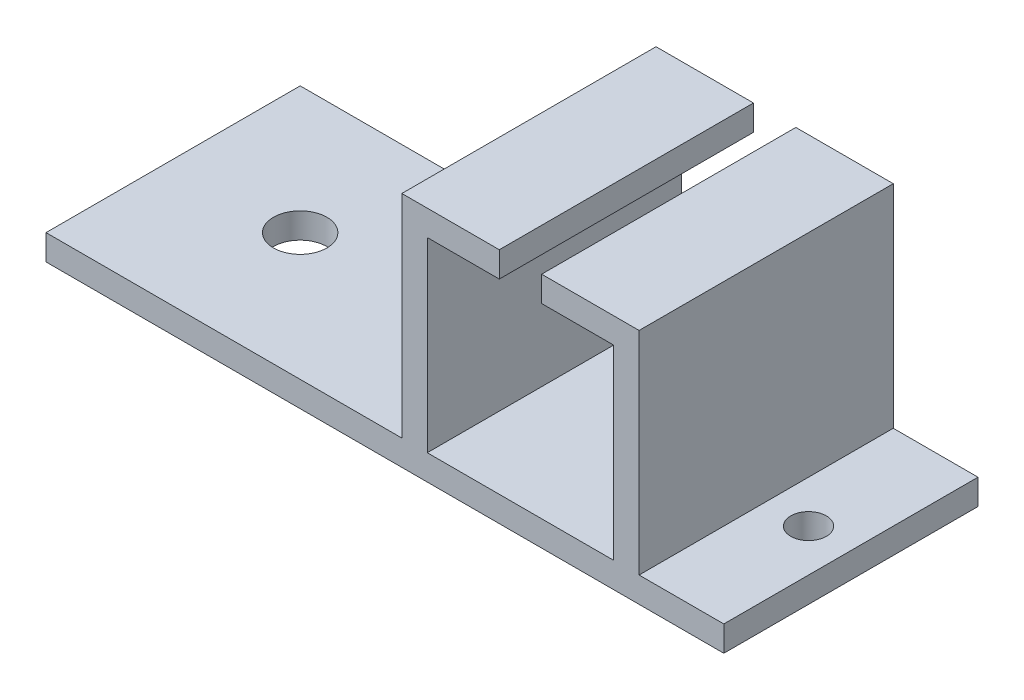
from build123d import *

# Parameters (mm, degrees)
SKETCH3_W           = 80
SKETCH3_H           = 3
BOSS_EXTRUDE1_DEPTH = 15
SKETCH4_W           = 28
SKETCH4_H           = 30
BOSS_EXTRUDE2_DEPTH = 25
SKETCH5_W           = 22
SKETCH5_H           = 22
CUT_EXTRUDE1_DEPTH  = 57.588426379
SKETCH6_R           = 2.1
CUT_EXTRUDE2_DEPTH  = 50.497474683
SKETCH7_R           = 3.15
CUT_EXTRUDE3_DEPTH  = 50.497474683
CUT_EXTRUDE4_DEPTH  = 10


with BuildPart() as part:
    # Sketch3 → Boss-Extrude1 (new, symmetric)
    with BuildSketch(Plane.XY):
        Rectangle(SKETCH3_W, SKETCH3_H)
    extrude(amount=BOSS_EXTRUDE1_DEPTH, both=True)

    # Sketch4 → Boss-Extrude2 (add)
    with BuildSketch(Plane(origin=(0, 1.5, 0), x_dir=(1, 0, 0), z_dir=(0, 1, 0))):
        with Locations((16, 0)):
            Rectangle(SKETCH4_W, SKETCH4_H)
    extrude(amount=BOSS_EXTRUDE2_DEPTH)

    # Sketch5 → Cut-Extrude1 (cut, through all)
    with BuildSketch(Plane.XY.offset(15)):
        with Locations((16, 12.5)):
            Rectangle(SKETCH5_W, SKETCH5_H)
    extrude(amount=-CUT_EXTRUDE1_DEPTH, mode=Mode.SUBTRACT)

    # Sketch6 → Cut-Extrude2 (cut, through all)
    with BuildSketch(Plane(origin=(0, 1.5, 0), x_dir=(1, 0, 0), z_dir=(0, 1, 0))):
        with Locations(Location((35, 0, 0), (0, 0, 270))):
            Circle(SKETCH6_R)
    extrude(amount=-CUT_EXTRUDE2_DEPTH, mode=Mode.SUBTRACT)

    # Sketch7 → Cut-Extrude3 (cut, through all)
    with BuildSketch(Plane(origin=(0, 1.5, 0), x_dir=(1, 0, 0), z_dir=(0, 1, 0))):
        with Locations(Location((-25, 0, 0), (0, 0, 270))):
            Circle(SKETCH7_R)
    extrude(amount=-CUT_EXTRUDE3_DEPTH, mode=Mode.SUBTRACT)

    # Sketch8 → Cut-Extrude4 (cut)
    with BuildSketch(Plane(origin=(0, 26.5, 0), x_dir=(1, 0, 0), z_dir=(0, 1, 0))):
        Polygon((18.5, 15), (18.5, -15), (16, -15), (13.5, -15), (13.5, 15), (16, 15), align=None)
    extrude(amount=-CUT_EXTRUDE4_DEPTH, mode=Mode.SUBTRACT)


solid = part.part
